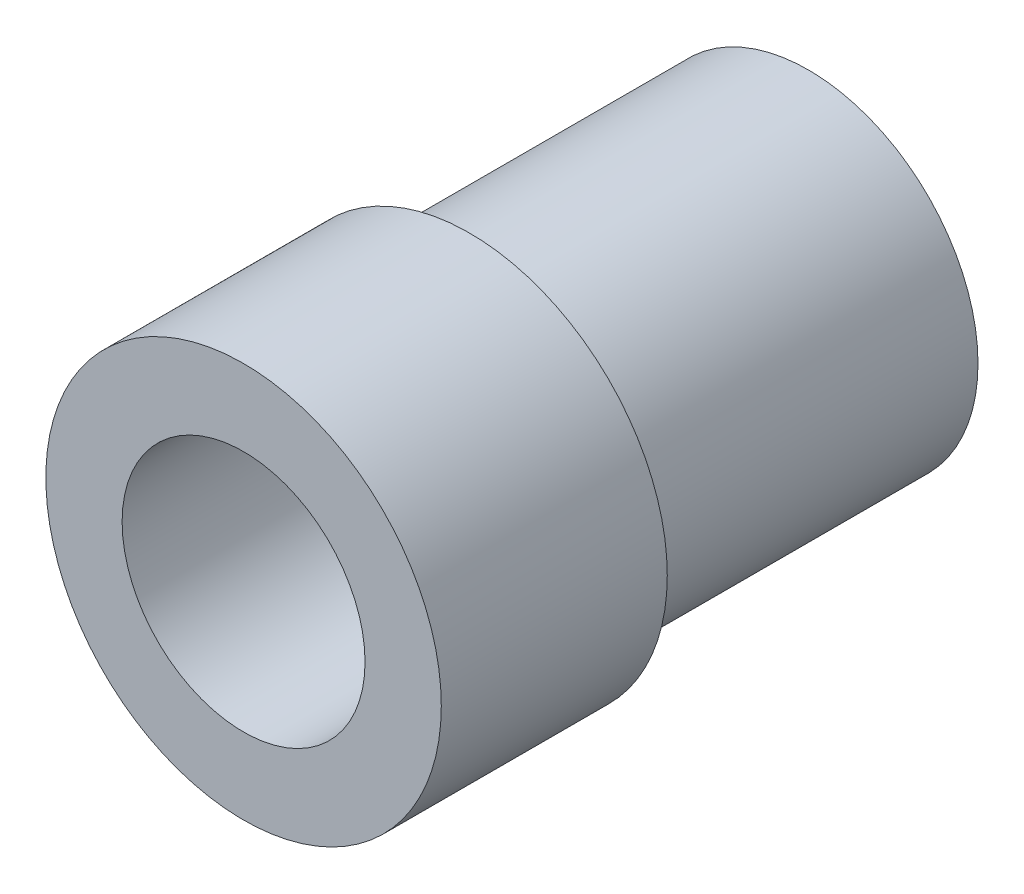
ISO-10303-21;
HEADER;
FILE_DESCRIPTION(('STEP AP214'),'2;1');
FILE_NAME('part.step','',(''),(''),'','','');
FILE_SCHEMA(('AUTOMOTIVE_DESIGN { 1 0 10303 214 1 1 1 1 }'));
ENDSEC;
DATA;
#1=APPLICATION_CONTEXT('core data for automotive mechanical design processes');
#2=APPLICATION_PROTOCOL_DEFINITION('international standard','automotive_design',2000,#1);
#3=PRODUCT_CONTEXT('',#1,'mechanical');
#4=PRODUCT('Part','Part','',(#3));
#5=PRODUCT_RELATED_PRODUCT_CATEGORY('part','',(#4));
#6=PRODUCT_DEFINITION_FORMATION('','',#4);
#7=PRODUCT_DEFINITION_CONTEXT('part definition',#1,'design');
#8=PRODUCT_DEFINITION('design','',#6,#7);
#9=PRODUCT_DEFINITION_SHAPE('','',#8);
#10=(LENGTH_UNIT() NAMED_UNIT(*) SI_UNIT(.MILLI.,.METRE.));
#11=(NAMED_UNIT(*) PLANE_ANGLE_UNIT() SI_UNIT($,.RADIAN.));
#12=(NAMED_UNIT(*) SI_UNIT($,.STERADIAN.) SOLID_ANGLE_UNIT());
#13=UNCERTAINTY_MEASURE_WITH_UNIT(LENGTH_MEASURE(1.E-05),#10,'distance_accuracy_value','');
#14=(GEOMETRIC_REPRESENTATION_CONTEXT(3) GLOBAL_UNCERTAINTY_ASSIGNED_CONTEXT((#13)) GLOBAL_UNIT_ASSIGNED_CONTEXT((#10,
#11,#12)) REPRESENTATION_CONTEXT('',''));
#15=CARTESIAN_POINT('',(0.,0.,0.));
#16=DIRECTION('',(0.,0.,1.));
#17=DIRECTION('',(1.,0.,0.));
#18=AXIS2_PLACEMENT_3D('',#15,#16,#17);
#19=CARTESIAN_POINT('',(0.,0.,0.));
#20=DIRECTION('',(0.,0.,1.));
#21=DIRECTION('',(1.,0.,0.));
#22=AXIS2_PLACEMENT_3D('',#19,#20,#21);
#23=PLANE('',#22);
#24=CARTESIAN_POINT('',(0.,0.,0.));
#25=DIRECTION('',(0.,0.,1.));
#26=DIRECTION('',(1.,0.,0.));
#27=AXIS2_PLACEMENT_3D('',#24,#25,#26);
#28=CIRCLE('',#27,3.);
#29=CARTESIAN_POINT('',(3.,0.,0.));
#30=VERTEX_POINT('',#29);
#31=EDGE_CURVE('E41',#30,#30,#28,.T.);
#32=ORIENTED_EDGE('',*,*,#31,.F.);
#33=EDGE_LOOP('',(#32));
#34=FACE_BOUND('',#33,.T.);
#35=CARTESIAN_POINT('',(0.,0.,0.));
#36=DIRECTION('',(0.,0.,1.));
#37=DIRECTION('',(1.,0.,0.));
#38=AXIS2_PLACEMENT_3D('',#35,#36,#37);
#39=CIRCLE('',#38,2.15);
#40=CARTESIAN_POINT('',(2.15,0.,0.));
#41=VERTEX_POINT('',#40);
#42=EDGE_CURVE('E50',#41,#41,#39,.T.);
#43=ORIENTED_EDGE('',*,*,#42,.T.);
#44=EDGE_LOOP('',(#43));
#45=FACE_BOUND('',#44,.T.);
#46=ADVANCED_FACE('F37',(#34,#45),#23,.F.);
#47=CARTESIAN_POINT('',(0.,0.,6.));
#48=DIRECTION('',(0.,0.,-1.));
#49=DIRECTION('',(-1.,0.,0.));
#50=AXIS2_PLACEMENT_3D('',#47,#48,#49);
#51=CYLINDRICAL_SURFACE('',#50,3.);
#52=CARTESIAN_POINT('',(0.,0.,6.));
#53=DIRECTION('',(0.,0.,1.));
#54=DIRECTION('',(1.,0.,0.));
#55=AXIS2_PLACEMENT_3D('',#52,#53,#54);
#56=CIRCLE('',#55,3.);
#57=CARTESIAN_POINT('',(3.,0.,6.));
#58=VERTEX_POINT('',#57);
#59=EDGE_CURVE('E10',#58,#58,#56,.T.);
#60=ORIENTED_EDGE('',*,*,#59,.F.);
#61=EDGE_LOOP('',(#60));
#62=FACE_BOUND('',#61,.T.);
#63=ORIENTED_EDGE('',*,*,#31,.T.);
#64=EDGE_LOOP('',(#63));
#65=FACE_BOUND('',#64,.T.);
#66=ADVANCED_FACE('F39',(#62,#65),#51,.T.);
#67=CARTESIAN_POINT('',(0.,0.,6.));
#68=DIRECTION('',(0.,0.,-1.));
#69=DIRECTION('',(-1.,0.,0.));
#70=AXIS2_PLACEMENT_3D('',#67,#68,#69);
#71=CYLINDRICAL_SURFACE('',#70,2.15);
#72=ORIENTED_EDGE('',*,*,#42,.F.);
#73=EDGE_LOOP('',(#72));
#74=FACE_BOUND('',#73,.T.);
#75=CARTESIAN_POINT('',(0.,0.,10.));
#76=DIRECTION('',(0.,0.,1.));
#77=DIRECTION('',(1.,0.,0.));
#78=AXIS2_PLACEMENT_3D('',#75,#76,#77);
#79=CIRCLE('',#78,2.15);
#80=CARTESIAN_POINT('',(2.15,0.,10.));
#81=VERTEX_POINT('',#80);
#82=EDGE_CURVE('E60',#81,#81,#79,.T.);
#83=ORIENTED_EDGE('',*,*,#82,.T.);
#84=EDGE_LOOP('',(#83));
#85=FACE_BOUND('',#84,.T.);
#86=ADVANCED_FACE('F68',(#74,#85),#71,.F.);
#87=CARTESIAN_POINT('',(0.,0.,10.));
#88=DIRECTION('',(0.,0.,1.));
#89=DIRECTION('',(1.,0.,0.));
#90=AXIS2_PLACEMENT_3D('',#87,#88,#89);
#91=PLANE('',#90);
#92=CARTESIAN_POINT('',(0.,0.,10.));
#93=DIRECTION('',(0.,0.,1.));
#94=DIRECTION('',(1.,0.,0.));
#95=AXIS2_PLACEMENT_3D('',#92,#93,#94);
#96=CIRCLE('',#95,3.5);
#97=CARTESIAN_POINT('',(3.5,0.,10.));
#98=VERTEX_POINT('',#97);
#99=EDGE_CURVE('E55',#98,#98,#96,.T.);
#100=ORIENTED_EDGE('',*,*,#99,.T.);
#101=EDGE_LOOP('',(#100));
#102=FACE_BOUND('',#101,.T.);
#103=ORIENTED_EDGE('',*,*,#82,.F.);
#104=EDGE_LOOP('',(#103));
#105=FACE_BOUND('',#104,.T.);
#106=ADVANCED_FACE('F70',(#102,#105),#91,.T.);
#107=CARTESIAN_POINT('',(0.,0.,6.));
#108=DIRECTION('',(0.,0.,1.));
#109=DIRECTION('',(1.,0.,0.));
#110=AXIS2_PLACEMENT_3D('',#107,#108,#109);
#111=PLANE('',#110);
#112=ORIENTED_EDGE('',*,*,#59,.T.);
#113=EDGE_LOOP('',(#112));
#114=FACE_BOUND('',#113,.T.);
#115=CARTESIAN_POINT('',(0.,0.,6.));
#116=DIRECTION('',(0.,0.,1.));
#117=DIRECTION('',(1.,0.,0.));
#118=AXIS2_PLACEMENT_3D('',#115,#116,#117);
#119=CIRCLE('',#118,3.5);
#120=CARTESIAN_POINT('',(3.5,0.,6.));
#121=VERTEX_POINT('',#120);
#122=EDGE_CURVE('E56',#121,#121,#119,.T.);
#123=ORIENTED_EDGE('',*,*,#122,.F.);
#124=EDGE_LOOP('',(#123));
#125=FACE_BOUND('',#124,.T.);
#126=ADVANCED_FACE('F72',(#114,#125),#111,.F.);
#127=CARTESIAN_POINT('',(0.,0.,10.));
#128=DIRECTION('',(0.,0.,-1.));
#129=DIRECTION('',(-1.,0.,0.));
#130=AXIS2_PLACEMENT_3D('',#127,#128,#129);
#131=CYLINDRICAL_SURFACE('',#130,3.5);
#132=ORIENTED_EDGE('',*,*,#99,.F.);
#133=EDGE_LOOP('',(#132));
#134=FACE_BOUND('',#133,.T.);
#135=ORIENTED_EDGE('',*,*,#122,.T.);
#136=EDGE_LOOP('',(#135));
#137=FACE_BOUND('',#136,.T.);
#138=ADVANCED_FACE('F79',(#134,#137),#131,.T.);
#139=CLOSED_SHELL('',(#46,#66,#86,#106,#126,#138));
#140=MANIFOLD_SOLID_BREP('B2',#139);
#141=ADVANCED_BREP_SHAPE_REPRESENTATION('',(#18,#140),#14);
#142=SHAPE_DEFINITION_REPRESENTATION(#9,#141);
ENDSEC;
END-ISO-10303-21;
